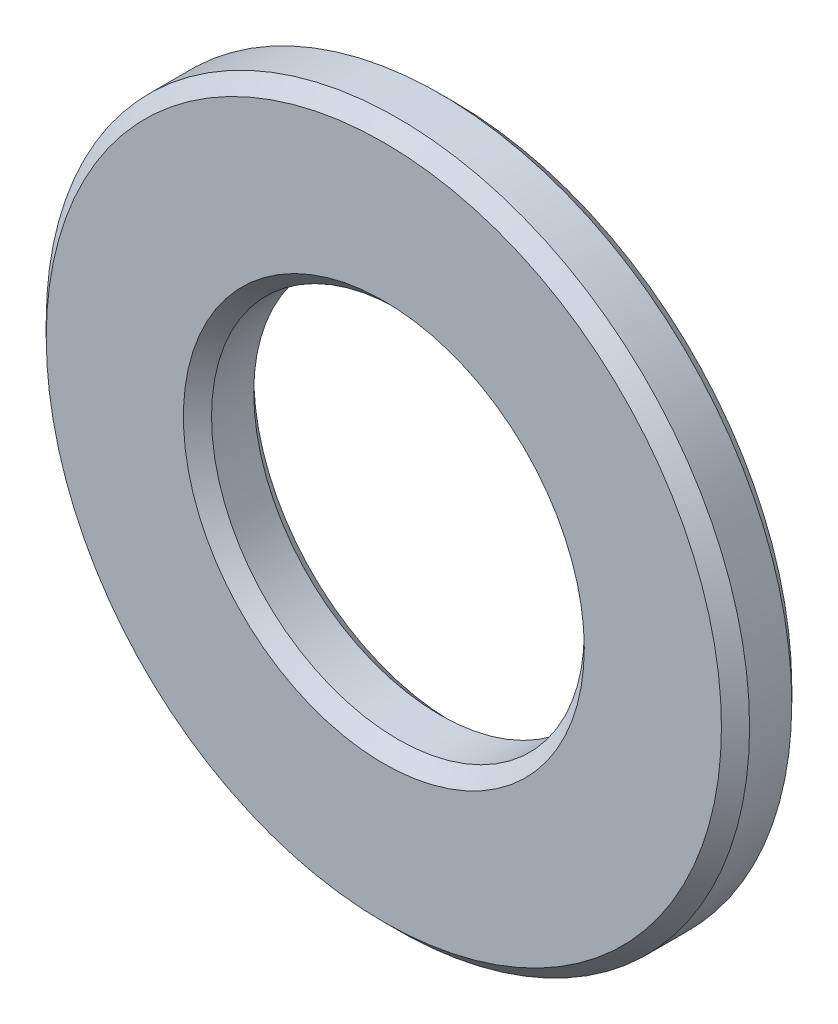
ISO-10303-21;
HEADER;
FILE_DESCRIPTION(('STEP AP214'),'2;1');
FILE_NAME('part.step','',(''),(''),'','','');
FILE_SCHEMA(('AUTOMOTIVE_DESIGN { 1 0 10303 214 1 1 1 1 }'));
ENDSEC;
DATA;
#1=APPLICATION_CONTEXT('core data for automotive mechanical design processes');
#2=APPLICATION_PROTOCOL_DEFINITION('international standard','automotive_design',2000,#1);
#3=PRODUCT_CONTEXT('',#1,'mechanical');
#4=PRODUCT('Part','Part','',(#3));
#5=PRODUCT_RELATED_PRODUCT_CATEGORY('part','',(#4));
#6=PRODUCT_DEFINITION_FORMATION('','',#4);
#7=PRODUCT_DEFINITION_CONTEXT('part definition',#1,'design');
#8=PRODUCT_DEFINITION('design','',#6,#7);
#9=PRODUCT_DEFINITION_SHAPE('','',#8);
#10=(LENGTH_UNIT() NAMED_UNIT(*) SI_UNIT(.MILLI.,.METRE.));
#11=(NAMED_UNIT(*) PLANE_ANGLE_UNIT() SI_UNIT($,.RADIAN.));
#12=(NAMED_UNIT(*) SI_UNIT($,.STERADIAN.) SOLID_ANGLE_UNIT());
#13=UNCERTAINTY_MEASURE_WITH_UNIT(LENGTH_MEASURE(1.E-05),#10,'distance_accuracy_value','');
#14=(GEOMETRIC_REPRESENTATION_CONTEXT(3) GLOBAL_UNCERTAINTY_ASSIGNED_CONTEXT((#13)) GLOBAL_UNIT_ASSIGNED_CONTEXT((#10,
#11,#12)) REPRESENTATION_CONTEXT('',''));
#15=CARTESIAN_POINT('',(0.,0.,0.));
#16=DIRECTION('',(0.,0.,1.));
#17=DIRECTION('',(1.,0.,0.));
#18=AXIS2_PLACEMENT_3D('',#15,#16,#17);
#19=CARTESIAN_POINT('',(0.,0.,0.5));
#20=DIRECTION('',(0.,0.,1.));
#21=DIRECTION('',(1.,0.,0.));
#22=AXIS2_PLACEMENT_3D('',#19,#20,#21);
#23=PLANE('',#22);
#24=CARTESIAN_POINT('',(0.,0.,0.5));
#25=DIRECTION('',(0.,0.,1.));
#26=DIRECTION('',(1.,0.,0.));
#27=AXIS2_PLACEMENT_3D('',#24,#25,#26);
#28=CIRCLE('',#27,2.85);
#29=CARTESIAN_POINT('',(2.85,0.,0.5));
#30=VERTEX_POINT('',#29);
#31=EDGE_CURVE('E10',#30,#30,#28,.F.);
#32=ORIENTED_EDGE('',*,*,#31,.T.);
#33=EDGE_LOOP('',(#32));
#34=FACE_BOUND('',#33,.T.);
#35=CARTESIAN_POINT('',(0.,0.,0.5));
#36=DIRECTION('',(0.,0.,1.));
#37=DIRECTION('',(1.,0.,0.));
#38=AXIS2_PLACEMENT_3D('',#35,#36,#37);
#39=CIRCLE('',#38,4.8);
#40=CARTESIAN_POINT('',(4.8,0.,0.5));
#41=VERTEX_POINT('',#40);
#42=EDGE_CURVE('E45',#41,#41,#39,.T.);
#43=ORIENTED_EDGE('',*,*,#42,.T.);
#44=EDGE_LOOP('',(#43));
#45=FACE_BOUND('',#44,.T.);
#46=ADVANCED_FACE('F37',(#34,#45),#23,.T.);
#47=CARTESIAN_POINT('',(0.,0.,-0.5));
#48=DIRECTION('',(0.,0.,1.));
#49=DIRECTION('',(1.,0.,0.));
#50=AXIS2_PLACEMENT_3D('',#47,#48,#49);
#51=PLANE('',#50);
#52=CARTESIAN_POINT('',(0.,0.,-0.5));
#53=DIRECTION('',(0.,0.,1.));
#54=DIRECTION('',(1.,0.,0.));
#55=AXIS2_PLACEMENT_3D('',#52,#53,#54);
#56=CIRCLE('',#55,4.8);
#57=CARTESIAN_POINT('',(4.8,0.,-0.5));
#58=VERTEX_POINT('',#57);
#59=EDGE_CURVE('E61',#58,#58,#56,.F.);
#60=ORIENTED_EDGE('',*,*,#59,.T.);
#61=EDGE_LOOP('',(#60));
#62=FACE_BOUND('',#61,.T.);
#63=CARTESIAN_POINT('',(0.,0.,-0.5));
#64=DIRECTION('',(0.,0.,1.));
#65=DIRECTION('',(1.,0.,0.));
#66=AXIS2_PLACEMENT_3D('',#63,#64,#65);
#67=CIRCLE('',#66,2.85);
#68=CARTESIAN_POINT('',(2.85,0.,-0.5));
#69=VERTEX_POINT('',#68);
#70=EDGE_CURVE('E65',#69,#69,#67,.T.);
#71=ORIENTED_EDGE('',*,*,#70,.T.);
#72=EDGE_LOOP('',(#71));
#73=FACE_BOUND('',#72,.T.);
#74=ADVANCED_FACE('F89',(#62,#73),#51,.F.);
#75=CARTESIAN_POINT('',(0.,0.,0.5));
#76=DIRECTION('',(0.,0.,-1.));
#77=DIRECTION('',(-1.,0.,0.));
#78=AXIS2_PLACEMENT_3D('',#75,#76,#77);
#79=CYLINDRICAL_SURFACE('',#78,5.);
#80=CARTESIAN_POINT('',(0.,0.,-0.3));
#81=DIRECTION('',(0.,0.,1.));
#82=DIRECTION('',(1.,0.,0.));
#83=AXIS2_PLACEMENT_3D('',#80,#81,#82);
#84=CIRCLE('',#83,5.);
#85=CARTESIAN_POINT('',(5.,0.,-0.3));
#86=VERTEX_POINT('',#85);
#87=EDGE_CURVE('E69',#86,#86,#84,.T.);
#88=ORIENTED_EDGE('',*,*,#87,.T.);
#89=EDGE_LOOP('',(#88));
#90=FACE_BOUND('',#89,.T.);
#91=CARTESIAN_POINT('',(0.,0.,0.299999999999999));
#92=DIRECTION('',(0.,0.,1.));
#93=DIRECTION('',(1.,0.,0.));
#94=AXIS2_PLACEMENT_3D('',#91,#92,#93);
#95=CIRCLE('',#94,5.);
#96=CARTESIAN_POINT('',(5.,0.,0.299999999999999));
#97=VERTEX_POINT('',#96);
#98=EDGE_CURVE('E73',#97,#97,#95,.F.);
#99=ORIENTED_EDGE('',*,*,#98,.T.);
#100=EDGE_LOOP('',(#99));
#101=FACE_BOUND('',#100,.T.);
#102=ADVANCED_FACE('F78',(#90,#101),#79,.T.);
#103=CARTESIAN_POINT('',(0.,0.,0.5));
#104=DIRECTION('',(0.,0.,-1.));
#105=DIRECTION('',(-1.,0.,0.));
#106=AXIS2_PLACEMENT_3D('',#103,#104,#105);
#107=CYLINDRICAL_SURFACE('',#106,2.65);
#108=CARTESIAN_POINT('',(0.,0.,-0.299999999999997));
#109=DIRECTION('',(0.,0.,1.));
#110=DIRECTION('',(1.,0.,0.));
#111=AXIS2_PLACEMENT_3D('',#108,#109,#110);
#112=CIRCLE('',#111,2.65);
#113=CARTESIAN_POINT('',(2.65,0.,-0.299999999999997));
#114=VERTEX_POINT('',#113);
#115=EDGE_CURVE('E50',#114,#114,#112,.F.);
#116=ORIENTED_EDGE('',*,*,#115,.T.);
#117=EDGE_LOOP('',(#116));
#118=FACE_BOUND('',#117,.T.);
#119=CARTESIAN_POINT('',(0.,0.,0.299999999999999));
#120=DIRECTION('',(0.,0.,1.));
#121=DIRECTION('',(1.,0.,0.));
#122=AXIS2_PLACEMENT_3D('',#119,#120,#121);
#123=CIRCLE('',#122,2.65);
#124=CARTESIAN_POINT('',(2.65,0.,0.299999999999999));
#125=VERTEX_POINT('',#124);
#126=EDGE_CURVE('E56',#125,#125,#123,.T.);
#127=ORIENTED_EDGE('',*,*,#126,.T.);
#128=EDGE_LOOP('',(#127));
#129=FACE_BOUND('',#128,.T.);
#130=ADVANCED_FACE('F97',(#118,#129),#107,.F.);
#131=CARTESIAN_POINT('',(0.,0.,-0.3));
#132=DIRECTION('',(0.,0.,1.));
#133=DIRECTION('',(1.,0.,0.));
#134=AXIS2_PLACEMENT_3D('',#131,#132,#133);
#135=CONICAL_SURFACE('',#134,5.,0.78539816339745);
#136=CARTESIAN_POINT('',(4.8,0.,-0.5));
#137=CARTESIAN_POINT('',(4.80208333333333,0.,-0.497916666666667));
#138=CARTESIAN_POINT('',(4.80416666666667,0.,-0.495833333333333));
#139=CARTESIAN_POINT('',(4.80833333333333,0.,-0.491666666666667));
#140=CARTESIAN_POINT('',(4.81041666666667,0.,-0.489583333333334));
#141=CARTESIAN_POINT('',(4.81458333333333,0.,-0.485416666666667));
#142=CARTESIAN_POINT('',(4.81666666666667,0.,-0.483333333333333));
#143=CARTESIAN_POINT('',(4.82083333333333,0.,-0.479166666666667));
#144=CARTESIAN_POINT('',(4.82291666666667,0.,-0.477083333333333));
#145=CARTESIAN_POINT('',(4.82708333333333,0.,-0.472916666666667));
#146=CARTESIAN_POINT('',(4.82916666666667,0.,-0.470833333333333));
#147=CARTESIAN_POINT('',(4.83333333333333,0.,-0.466666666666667));
#148=CARTESIAN_POINT('',(4.83541666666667,0.,-0.464583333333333));
#149=CARTESIAN_POINT('',(4.83958333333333,0.,-0.460416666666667));
#150=CARTESIAN_POINT('',(4.84166666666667,0.,-0.458333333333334));
#151=CARTESIAN_POINT('',(4.84583333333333,0.,-0.454166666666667));
#152=CARTESIAN_POINT('',(4.84791666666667,0.,-0.452083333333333));
#153=CARTESIAN_POINT('',(4.85208333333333,0.,-0.447916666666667));
#154=CARTESIAN_POINT('',(4.85416666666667,0.,-0.445833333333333));
#155=CARTESIAN_POINT('',(4.85833333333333,0.,-0.441666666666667));
#156=CARTESIAN_POINT('',(4.86041666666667,0.,-0.439583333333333));
#157=CARTESIAN_POINT('',(4.86458333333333,0.,-0.435416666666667));
#158=CARTESIAN_POINT('',(4.86666666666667,0.,-0.433333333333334));
#159=CARTESIAN_POINT('',(4.87083333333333,0.,-0.429166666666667));
#160=CARTESIAN_POINT('',(4.87291666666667,0.,-0.427083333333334));
#161=CARTESIAN_POINT('',(4.87708333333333,0.,-0.422916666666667));
#162=CARTESIAN_POINT('',(4.87916666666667,0.,-0.420833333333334));
#163=CARTESIAN_POINT('',(4.88333333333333,0.,-0.416666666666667));
#164=CARTESIAN_POINT('',(4.88541666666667,0.,-0.414583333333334));
#165=CARTESIAN_POINT('',(4.88958333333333,0.,-0.410416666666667));
#166=CARTESIAN_POINT('',(4.89166666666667,0.,-0.408333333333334));
#167=CARTESIAN_POINT('',(4.89583333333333,0.,-0.404166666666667));
#168=CARTESIAN_POINT('',(4.89791666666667,0.,-0.402083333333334));
#169=CARTESIAN_POINT('',(4.90208333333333,0.,-0.397916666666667));
#170=CARTESIAN_POINT('',(4.90416666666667,0.,-0.395833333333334));
#171=CARTESIAN_POINT('',(4.90833333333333,0.,-0.391666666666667));
#172=CARTESIAN_POINT('',(4.91041666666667,0.,-0.389583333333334));
#173=CARTESIAN_POINT('',(4.91458333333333,0.,-0.385416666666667));
#174=CARTESIAN_POINT('',(4.91666666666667,0.,-0.383333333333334));
#175=CARTESIAN_POINT('',(4.92083333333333,0.,-0.379166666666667));
#176=CARTESIAN_POINT('',(4.92291666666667,0.,-0.377083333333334));
#177=CARTESIAN_POINT('',(4.92708333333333,0.,-0.372916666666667));
#178=CARTESIAN_POINT('',(4.92916666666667,0.,-0.370833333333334));
#179=CARTESIAN_POINT('',(4.93333333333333,0.,-0.366666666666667));
#180=CARTESIAN_POINT('',(4.93541666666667,0.,-0.364583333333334));
#181=CARTESIAN_POINT('',(4.93958333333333,0.,-0.360416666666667));
#182=CARTESIAN_POINT('',(4.94166666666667,0.,-0.358333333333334));
#183=CARTESIAN_POINT('',(4.94583333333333,0.,-0.354166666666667));
#184=CARTESIAN_POINT('',(4.94791666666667,0.,-0.352083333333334));
#185=CARTESIAN_POINT('',(4.95208333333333,0.,-0.347916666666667));
#186=CARTESIAN_POINT('',(4.95416666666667,0.,-0.345833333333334));
#187=CARTESIAN_POINT('',(4.95833333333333,0.,-0.341666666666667));
#188=CARTESIAN_POINT('',(4.96041666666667,0.,-0.339583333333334));
#189=CARTESIAN_POINT('',(4.96458333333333,0.,-0.335416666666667));
#190=CARTESIAN_POINT('',(4.96666666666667,0.,-0.333333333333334));
#191=CARTESIAN_POINT('',(4.97083333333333,0.,-0.329166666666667));
#192=CARTESIAN_POINT('',(4.97291666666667,0.,-0.327083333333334));
#193=CARTESIAN_POINT('',(4.97708333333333,0.,-0.322916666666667));
#194=CARTESIAN_POINT('',(4.97916666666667,0.,-0.320833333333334));
#195=CARTESIAN_POINT('',(4.98333333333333,0.,-0.316666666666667));
#196=CARTESIAN_POINT('',(4.98541666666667,0.,-0.314583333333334));
#197=CARTESIAN_POINT('',(4.98958333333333,0.,-0.310416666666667));
#198=CARTESIAN_POINT('',(4.99166666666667,0.,-0.308333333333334));
#199=CARTESIAN_POINT('',(4.99583333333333,0.,-0.304166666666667));
#200=CARTESIAN_POINT('',(4.99791666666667,0.,-0.302083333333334));
#201=CARTESIAN_POINT('',(5.,0.,-0.3));
#202=B_SPLINE_CURVE_WITH_KNOTS('',3,(#136,#137,#138,#139,#140,#141,#142,#143,#144,#145,#146,
#147,#148,#149,#150,#151,#152,#153,#154,#155,#156,#157,#158,#159,#160,#161,#162,#163,#164,#165,
#166,#167,#168,#169,#170,#171,#172,#173,#174,#175,#176,#177,#178,#179,#180,#181,#182,#183,#184,
#185,#186,#187,#188,#189,#190,#191,#192,#193,#194,#195,#196,#197,#198,#199,#200,#201),
.UNSPECIFIED.,.F.,.F.,(4,2,2,2,2,2,2,2,2,2,2,2,2,2,2,2,2,2,2,2,2,2,2,2,2,2,2,2,2,2,2,2,4),(0.,
0.00883883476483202,0.017677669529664,0.0265165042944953,0.0353553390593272,0.0441941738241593,
0.0530330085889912,0.0618718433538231,0.0707106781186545,0.0795495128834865,0.0883883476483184,
0.0972271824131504,0.106066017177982,0.114904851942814,0.123743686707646,0.132582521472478,
0.14142135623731,0.150260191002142,0.159099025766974,0.167937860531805,0.176776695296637,
0.185615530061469,0.194454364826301,0.203293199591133,0.212132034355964,0.220970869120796,
0.229809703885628,0.23864853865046,0.247487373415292,0.256326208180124,0.265165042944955,
0.274003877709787,0.282842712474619),.UNSPECIFIED.);
#203=EDGE_CURVE('BSEAM102',#58,#86,#202,.T.);
#204=ORIENTED_EDGE('',*,*,#59,.F.);
#205=ORIENTED_EDGE('',*,*,#87,.F.);
#206=ORIENTED_EDGE('',*,*,#203,.T.);
#207=ORIENTED_EDGE('',*,*,#203,.F.);
#208=EDGE_LOOP('',(#204,#206,#205,#207));
#209=FACE_BOUND('',#208,.T.);
#210=ADVANCED_FACE('F102',(#209),#135,.T.);
#211=CARTESIAN_POINT('',(0.,0.,-0.5));
#212=DIRECTION('',(0.,0.,-1.));
#213=DIRECTION('',(-1.,0.,0.));
#214=AXIS2_PLACEMENT_3D('',#211,#212,#213);
#215=CONICAL_SURFACE('',#214,2.85,0.785398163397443);
#216=ORIENTED_EDGE('',*,*,#115,.F.);
#217=EDGE_LOOP('',(#216));
#218=FACE_BOUND('',#217,.T.);
#219=ORIENTED_EDGE('',*,*,#70,.F.);
#220=EDGE_LOOP('',(#219));
#221=FACE_BOUND('',#220,.T.);
#222=ADVANCED_FACE('F86',(#218,#221),#215,.F.);
#223=CARTESIAN_POINT('',(0.,0.,0.299999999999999));
#224=DIRECTION('',(0.,0.,1.));
#225=DIRECTION('',(1.,0.,0.));
#226=AXIS2_PLACEMENT_3D('',#223,#224,#225);
#227=CONICAL_SURFACE('',#226,2.65,0.785398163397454);
#228=ORIENTED_EDGE('',*,*,#31,.F.);
#229=EDGE_LOOP('',(#228));
#230=FACE_BOUND('',#229,.T.);
#231=ORIENTED_EDGE('',*,*,#126,.F.);
#232=EDGE_LOOP('',(#231));
#233=FACE_BOUND('',#232,.T.);
#234=ADVANCED_FACE('F82',(#230,#233),#227,.F.);
#235=CARTESIAN_POINT('',(0.,0.,0.5));
#236=DIRECTION('',(0.,0.,-1.));
#237=DIRECTION('',(-1.,0.,0.));
#238=AXIS2_PLACEMENT_3D('',#235,#236,#237);
#239=CONICAL_SURFACE('',#238,4.8,0.785398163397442);
#240=ORIENTED_EDGE('',*,*,#98,.F.);
#241=EDGE_LOOP('',(#240));
#242=FACE_BOUND('',#241,.T.);
#243=ORIENTED_EDGE('',*,*,#42,.F.);
#244=EDGE_LOOP('',(#243));
#245=FACE_BOUND('',#244,.T.);
#246=ADVANCED_FACE('F39',(#242,#245),#239,.T.);
#247=CLOSED_SHELL('',(#46,#74,#102,#130,#210,#222,#234,#246));
#248=MANIFOLD_SOLID_BREP('B2',#247);
#249=ADVANCED_BREP_SHAPE_REPRESENTATION('',(#18,#248),#14);
#250=SHAPE_DEFINITION_REPRESENTATION(#9,#249);
ENDSEC;
END-ISO-10303-21;
